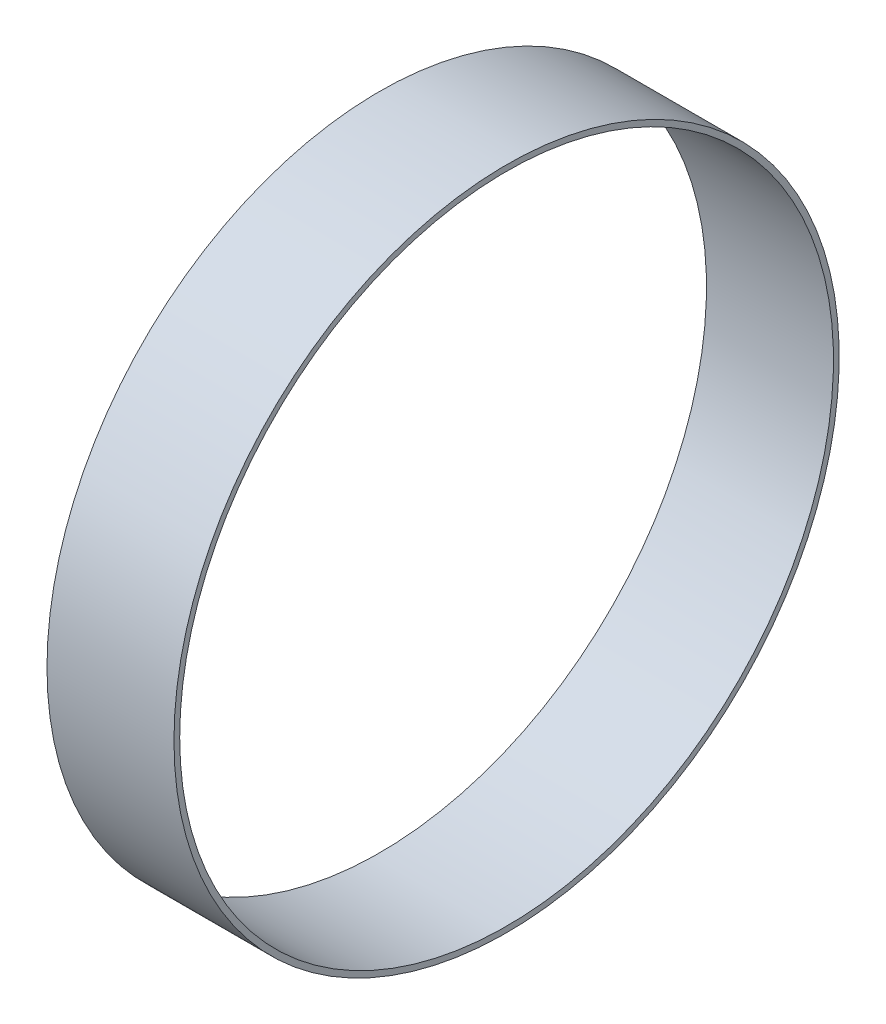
ISO-10303-21;
HEADER;
FILE_DESCRIPTION(('STEP AP214'),'2;1');
FILE_NAME('part.step','',(''),(''),'','','');
FILE_SCHEMA(('AUTOMOTIVE_DESIGN { 1 0 10303 214 1 1 1 1 }'));
ENDSEC;
DATA;
#1=APPLICATION_CONTEXT('core data for automotive mechanical design processes');
#2=APPLICATION_PROTOCOL_DEFINITION('international standard','automotive_design',2000,#1);
#3=PRODUCT_CONTEXT('',#1,'mechanical');
#4=PRODUCT('Part','Part','',(#3));
#5=PRODUCT_RELATED_PRODUCT_CATEGORY('part','',(#4));
#6=PRODUCT_DEFINITION_FORMATION('','',#4);
#7=PRODUCT_DEFINITION_CONTEXT('part definition',#1,'design');
#8=PRODUCT_DEFINITION('design','',#6,#7);
#9=PRODUCT_DEFINITION_SHAPE('','',#8);
#10=(LENGTH_UNIT() NAMED_UNIT(*) SI_UNIT(.MILLI.,.METRE.));
#11=(NAMED_UNIT(*) PLANE_ANGLE_UNIT() SI_UNIT($,.RADIAN.));
#12=(NAMED_UNIT(*) SI_UNIT($,.STERADIAN.) SOLID_ANGLE_UNIT());
#13=UNCERTAINTY_MEASURE_WITH_UNIT(LENGTH_MEASURE(1.E-05),#10,'distance_accuracy_value','');
#14=(GEOMETRIC_REPRESENTATION_CONTEXT(3) GLOBAL_UNCERTAINTY_ASSIGNED_CONTEXT((#13)) GLOBAL_UNIT_ASSIGNED_CONTEXT((#10,
#11,#12)) REPRESENTATION_CONTEXT('',''));
#15=CARTESIAN_POINT('',(0.,0.,0.));
#16=DIRECTION('',(0.,0.,1.));
#17=DIRECTION('',(1.,0.,0.));
#18=AXIS2_PLACEMENT_3D('',#15,#16,#17);
#19=CARTESIAN_POINT('',(56.2102,0.,0.));
#20=DIRECTION('',(1.,0.,0.));
#21=DIRECTION('',(0.,0.,-1.));
#22=AXIS2_PLACEMENT_3D('',#19,#20,#21);
#23=PLANE('',#22);
#24=CARTESIAN_POINT('',(56.2102,0.,0.));
#25=DIRECTION('',(1.,0.,0.));
#26=DIRECTION('',(0.,0.,-1.));
#27=AXIS2_PLACEMENT_3D('',#24,#25,#26);
#28=CIRCLE('',#27,147.2438);
#29=CARTESIAN_POINT('',(56.2102,0.,147.2438));
#30=VERTEX_POINT('',#29);
#31=EDGE_CURVE('E10',#30,#30,#28,.T.);
#32=ORIENTED_EDGE('',*,*,#31,.T.);
#33=EDGE_LOOP('',(#32));
#34=FACE_BOUND('',#33,.T.);
#35=CARTESIAN_POINT('',(56.2102,0.,0.));
#36=DIRECTION('',(1.,0.,0.));
#37=DIRECTION('',(0.,0.,-1.));
#38=AXIS2_PLACEMENT_3D('',#35,#36,#37);
#39=CIRCLE('',#38,144.7038);
#40=CARTESIAN_POINT('',(56.2102,0.,144.7038));
#41=VERTEX_POINT('',#40);
#42=EDGE_CURVE('E43',#41,#41,#39,.T.);
#43=ORIENTED_EDGE('',*,*,#42,.F.);
#44=EDGE_LOOP('',(#43));
#45=FACE_BOUND('',#44,.T.);
#46=ADVANCED_FACE('F32',(#34,#45),#23,.T.);
#47=CARTESIAN_POINT('',(0.,0.,0.));
#48=DIRECTION('',(1.,0.,0.));
#49=DIRECTION('',(0.,0.,-1.));
#50=AXIS2_PLACEMENT_3D('',#47,#48,#49);
#51=PLANE('',#50);
#52=CARTESIAN_POINT('',(0.,0.,0.));
#53=DIRECTION('',(1.,0.,0.));
#54=DIRECTION('',(0.,0.,-1.));
#55=AXIS2_PLACEMENT_3D('',#52,#53,#54);
#56=CIRCLE('',#55,147.2438);
#57=CARTESIAN_POINT('',(0.,0.,147.2438));
#58=VERTEX_POINT('',#57);
#59=EDGE_CURVE('E36',#58,#58,#56,.T.);
#60=ORIENTED_EDGE('',*,*,#59,.F.);
#61=EDGE_LOOP('',(#60));
#62=FACE_BOUND('',#61,.T.);
#63=CARTESIAN_POINT('',(0.,0.,0.));
#64=DIRECTION('',(1.,0.,0.));
#65=DIRECTION('',(0.,0.,-1.));
#66=AXIS2_PLACEMENT_3D('',#63,#64,#65);
#67=CIRCLE('',#66,144.7038);
#68=CARTESIAN_POINT('',(0.,0.,144.7038));
#69=VERTEX_POINT('',#68);
#70=EDGE_CURVE('E45',#69,#69,#67,.T.);
#71=ORIENTED_EDGE('',*,*,#70,.T.);
#72=EDGE_LOOP('',(#71));
#73=FACE_BOUND('',#72,.T.);
#74=ADVANCED_FACE('F55',(#62,#73),#51,.F.);
#75=CARTESIAN_POINT('',(56.2102,0.,0.));
#76=DIRECTION('',(-1.,0.,0.));
#77=DIRECTION('',(0.,0.,1.));
#78=AXIS2_PLACEMENT_3D('',#75,#76,#77);
#79=CYLINDRICAL_SURFACE('',#78,147.2438);
#80=CARTESIAN_POINT('',(56.2102,0.,147.2438));
#81=CARTESIAN_POINT('',(55.6246770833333,0.,147.2438));
#82=CARTESIAN_POINT('',(55.0391541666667,0.,147.2438));
#83=CARTESIAN_POINT('',(53.8681083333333,0.,147.2438));
#84=CARTESIAN_POINT('',(53.2825854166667,0.,147.2438));
#85=CARTESIAN_POINT('',(52.1115395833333,0.,147.2438));
#86=CARTESIAN_POINT('',(51.5260166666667,0.,147.2438));
#87=CARTESIAN_POINT('',(50.3549708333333,0.,147.2438));
#88=CARTESIAN_POINT('',(49.7694479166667,0.,147.2438));
#89=CARTESIAN_POINT('',(48.5984020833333,0.,147.2438));
#90=CARTESIAN_POINT('',(48.0128791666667,0.,147.2438));
#91=CARTESIAN_POINT('',(46.8418333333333,0.,147.2438));
#92=CARTESIAN_POINT('',(46.2563104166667,0.,147.2438));
#93=CARTESIAN_POINT('',(45.0852645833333,0.,147.2438));
#94=CARTESIAN_POINT('',(44.4997416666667,0.,147.2438));
#95=CARTESIAN_POINT('',(43.3286958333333,0.,147.2438));
#96=CARTESIAN_POINT('',(42.7431729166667,0.,147.2438));
#97=CARTESIAN_POINT('',(41.5721270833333,0.,147.2438));
#98=CARTESIAN_POINT('',(40.9866041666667,0.,147.2438));
#99=CARTESIAN_POINT('',(39.8155583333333,0.,147.2438));
#100=CARTESIAN_POINT('',(39.2300354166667,0.,147.2438));
#101=CARTESIAN_POINT('',(38.0589895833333,0.,147.2438));
#102=CARTESIAN_POINT('',(37.4734666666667,0.,147.2438));
#103=CARTESIAN_POINT('',(36.3024208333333,0.,147.2438));
#104=CARTESIAN_POINT('',(35.7168979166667,0.,147.2438));
#105=CARTESIAN_POINT('',(34.5458520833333,0.,147.2438));
#106=CARTESIAN_POINT('',(33.9603291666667,0.,147.2438));
#107=CARTESIAN_POINT('',(32.7892833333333,0.,147.2438));
#108=CARTESIAN_POINT('',(32.2037604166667,0.,147.2438));
#109=CARTESIAN_POINT('',(31.0327145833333,0.,147.2438));
#110=CARTESIAN_POINT('',(30.4471916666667,0.,147.2438));
#111=CARTESIAN_POINT('',(29.2761458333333,0.,147.2438));
#112=CARTESIAN_POINT('',(28.6906229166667,0.,147.2438));
#113=CARTESIAN_POINT('',(27.5195770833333,0.,147.2438));
#114=CARTESIAN_POINT('',(26.9340541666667,0.,147.2438));
#115=CARTESIAN_POINT('',(25.7630083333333,0.,147.2438));
#116=CARTESIAN_POINT('',(25.1774854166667,0.,147.2438));
#117=CARTESIAN_POINT('',(24.0064395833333,0.,147.2438));
#118=CARTESIAN_POINT('',(23.4209166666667,0.,147.2438));
#119=CARTESIAN_POINT('',(22.2498708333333,0.,147.2438));
#120=CARTESIAN_POINT('',(21.6643479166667,0.,147.2438));
#121=CARTESIAN_POINT('',(20.4933020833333,0.,147.2438));
#122=CARTESIAN_POINT('',(19.9077791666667,0.,147.2438));
#123=CARTESIAN_POINT('',(18.7367333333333,0.,147.2438));
#124=CARTESIAN_POINT('',(18.1512104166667,0.,147.2438));
#125=CARTESIAN_POINT('',(16.9801645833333,0.,147.2438));
#126=CARTESIAN_POINT('',(16.3946416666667,0.,147.2438));
#127=CARTESIAN_POINT('',(15.2235958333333,0.,147.2438));
#128=CARTESIAN_POINT('',(14.6380729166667,0.,147.2438));
#129=CARTESIAN_POINT('',(13.4670270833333,0.,147.2438));
#130=CARTESIAN_POINT('',(12.8815041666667,0.,147.2438));
#131=CARTESIAN_POINT('',(11.7104583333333,0.,147.2438));
#132=CARTESIAN_POINT('',(11.1249354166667,0.,147.2438));
#133=CARTESIAN_POINT('',(9.95388958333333,0.,147.2438));
#134=CARTESIAN_POINT('',(9.36836666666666,0.,147.2438));
#135=CARTESIAN_POINT('',(8.19732083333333,0.,147.2438));
#136=CARTESIAN_POINT('',(7.61179791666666,0.,147.2438));
#137=CARTESIAN_POINT('',(6.44075208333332,0.,147.2438));
#138=CARTESIAN_POINT('',(5.85522916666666,0.,147.2438));
#139=CARTESIAN_POINT('',(4.68418333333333,0.,147.2438));
#140=CARTESIAN_POINT('',(4.09866041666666,0.,147.2438));
#141=CARTESIAN_POINT('',(2.92761458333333,0.,147.2438));
#142=CARTESIAN_POINT('',(2.34209166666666,0.,147.2438));
#143=CARTESIAN_POINT('',(1.17104583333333,0.,147.2438));
#144=CARTESIAN_POINT('',(0.58552291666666,0.,147.2438));
#145=CARTESIAN_POINT('',(0.,0.,147.2438));
#146=B_SPLINE_CURVE_WITH_KNOTS('',3,(#80,#81,#82,#83,#84,#85,#86,#87,#88,#89,#90,#91,#92,#93,
#94,#95,#96,#97,#98,#99,#100,#101,#102,#103,#104,#105,#106,#107,#108,#109,#110,#111,#112,#113,
#114,#115,#116,#117,#118,#119,#120,#121,#122,#123,#124,#125,#126,#127,#128,#129,#130,#131,#132,
#133,#134,#135,#136,#137,#138,#139,#140,#141,#142,#143,#144,#145),.UNSPECIFIED.,.F.,.F.,(4,2,2,
2,2,2,2,2,2,2,2,2,2,2,2,2,2,2,2,2,2,2,2,2,2,2,2,2,2,2,2,2,4),(0.,1.75656875,3.5131375,
5.26970625,7.026275,8.78284375,10.5394125,12.29598125,14.05255,15.80911875,17.5656875,
19.32225625,21.078825,22.83539375,24.5919625,26.34853125,28.1051,29.86166875,31.6182375,
33.37480625,35.131375,36.88794375,38.6445125,40.40108125,42.15765,43.91421875,45.6707875,
47.42735625,49.183925,50.94049375,52.6970625,54.45363125,56.2102),.UNSPECIFIED.);
#147=EDGE_CURVE('BSEAM34',#30,#58,#146,.T.);
#148=ORIENTED_EDGE('',*,*,#31,.F.);
#149=ORIENTED_EDGE('',*,*,#59,.T.);
#150=ORIENTED_EDGE('',*,*,#147,.T.);
#151=ORIENTED_EDGE('',*,*,#147,.F.);
#152=EDGE_LOOP('',(#148,#150,#149,#151));
#153=FACE_BOUND('',#152,.T.);
#154=ADVANCED_FACE('F34',(#153),#79,.T.);
#155=CARTESIAN_POINT('',(56.2102,0.,0.));
#156=DIRECTION('',(-1.,0.,0.));
#157=DIRECTION('',(0.,0.,1.));
#158=AXIS2_PLACEMENT_3D('',#155,#156,#157);
#159=CYLINDRICAL_SURFACE('',#158,144.7038);
#160=CARTESIAN_POINT('',(56.2102,0.,144.7038));
#161=CARTESIAN_POINT('',(55.6246770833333,0.,144.7038));
#162=CARTESIAN_POINT('',(55.0391541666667,0.,144.7038));
#163=CARTESIAN_POINT('',(53.8681083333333,0.,144.7038));
#164=CARTESIAN_POINT('',(53.2825854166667,0.,144.7038));
#165=CARTESIAN_POINT('',(52.1115395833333,0.,144.7038));
#166=CARTESIAN_POINT('',(51.5260166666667,0.,144.7038));
#167=CARTESIAN_POINT('',(50.3549708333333,0.,144.7038));
#168=CARTESIAN_POINT('',(49.7694479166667,0.,144.7038));
#169=CARTESIAN_POINT('',(48.5984020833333,0.,144.7038));
#170=CARTESIAN_POINT('',(48.0128791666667,0.,144.7038));
#171=CARTESIAN_POINT('',(46.8418333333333,0.,144.7038));
#172=CARTESIAN_POINT('',(46.2563104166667,0.,144.7038));
#173=CARTESIAN_POINT('',(45.0852645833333,0.,144.7038));
#174=CARTESIAN_POINT('',(44.4997416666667,0.,144.7038));
#175=CARTESIAN_POINT('',(43.3286958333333,0.,144.7038));
#176=CARTESIAN_POINT('',(42.7431729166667,0.,144.7038));
#177=CARTESIAN_POINT('',(41.5721270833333,0.,144.7038));
#178=CARTESIAN_POINT('',(40.9866041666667,0.,144.7038));
#179=CARTESIAN_POINT('',(39.8155583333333,0.,144.7038));
#180=CARTESIAN_POINT('',(39.2300354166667,0.,144.7038));
#181=CARTESIAN_POINT('',(38.0589895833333,0.,144.7038));
#182=CARTESIAN_POINT('',(37.4734666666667,0.,144.7038));
#183=CARTESIAN_POINT('',(36.3024208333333,0.,144.7038));
#184=CARTESIAN_POINT('',(35.7168979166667,0.,144.7038));
#185=CARTESIAN_POINT('',(34.5458520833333,0.,144.7038));
#186=CARTESIAN_POINT('',(33.9603291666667,0.,144.7038));
#187=CARTESIAN_POINT('',(32.7892833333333,0.,144.7038));
#188=CARTESIAN_POINT('',(32.2037604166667,0.,144.7038));
#189=CARTESIAN_POINT('',(31.0327145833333,0.,144.7038));
#190=CARTESIAN_POINT('',(30.4471916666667,0.,144.7038));
#191=CARTESIAN_POINT('',(29.2761458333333,0.,144.7038));
#192=CARTESIAN_POINT('',(28.6906229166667,0.,144.7038));
#193=CARTESIAN_POINT('',(27.5195770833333,0.,144.7038));
#194=CARTESIAN_POINT('',(26.9340541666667,0.,144.7038));
#195=CARTESIAN_POINT('',(25.7630083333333,0.,144.7038));
#196=CARTESIAN_POINT('',(25.1774854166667,0.,144.7038));
#197=CARTESIAN_POINT('',(24.0064395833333,0.,144.7038));
#198=CARTESIAN_POINT('',(23.4209166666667,0.,144.7038));
#199=CARTESIAN_POINT('',(22.2498708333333,0.,144.7038));
#200=CARTESIAN_POINT('',(21.6643479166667,0.,144.7038));
#201=CARTESIAN_POINT('',(20.4933020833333,0.,144.7038));
#202=CARTESIAN_POINT('',(19.9077791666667,0.,144.7038));
#203=CARTESIAN_POINT('',(18.7367333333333,0.,144.7038));
#204=CARTESIAN_POINT('',(18.1512104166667,0.,144.7038));
#205=CARTESIAN_POINT('',(16.9801645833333,0.,144.7038));
#206=CARTESIAN_POINT('',(16.3946416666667,0.,144.7038));
#207=CARTESIAN_POINT('',(15.2235958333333,0.,144.7038));
#208=CARTESIAN_POINT('',(14.6380729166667,0.,144.7038));
#209=CARTESIAN_POINT('',(13.4670270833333,0.,144.7038));
#210=CARTESIAN_POINT('',(12.8815041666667,0.,144.7038));
#211=CARTESIAN_POINT('',(11.7104583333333,0.,144.7038));
#212=CARTESIAN_POINT('',(11.1249354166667,0.,144.7038));
#213=CARTESIAN_POINT('',(9.95388958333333,0.,144.7038));
#214=CARTESIAN_POINT('',(9.36836666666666,0.,144.7038));
#215=CARTESIAN_POINT('',(8.19732083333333,0.,144.7038));
#216=CARTESIAN_POINT('',(7.61179791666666,0.,144.7038));
#217=CARTESIAN_POINT('',(6.44075208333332,0.,144.7038));
#218=CARTESIAN_POINT('',(5.85522916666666,0.,144.7038));
#219=CARTESIAN_POINT('',(4.68418333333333,0.,144.7038));
#220=CARTESIAN_POINT('',(4.09866041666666,0.,144.7038));
#221=CARTESIAN_POINT('',(2.92761458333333,0.,144.7038));
#222=CARTESIAN_POINT('',(2.34209166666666,0.,144.7038));
#223=CARTESIAN_POINT('',(1.17104583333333,0.,144.7038));
#224=CARTESIAN_POINT('',(0.58552291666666,0.,144.7038));
#225=CARTESIAN_POINT('',(0.,0.,144.7038));
#226=B_SPLINE_CURVE_WITH_KNOTS('',3,(#160,#161,#162,#163,#164,#165,#166,#167,#168,#169,#170,
#171,#172,#173,#174,#175,#176,#177,#178,#179,#180,#181,#182,#183,#184,#185,#186,#187,#188,#189,
#190,#191,#192,#193,#194,#195,#196,#197,#198,#199,#200,#201,#202,#203,#204,#205,#206,#207,#208,
#209,#210,#211,#212,#213,#214,#215,#216,#217,#218,#219,#220,#221,#222,#223,#224,#225),
.UNSPECIFIED.,.F.,.F.,(4,2,2,2,2,2,2,2,2,2,2,2,2,2,2,2,2,2,2,2,2,2,2,2,2,2,2,2,2,2,2,2,4),(0.,
1.75656875,3.5131375,5.26970625,7.026275,8.78284375,10.5394125,12.29598125,14.05255,15.80911875,
17.5656875,19.32225625,21.078825,22.83539375,24.5919625,26.34853125,28.1051,29.86166875,
31.6182375,33.37480625,35.131375,36.88794375,38.6445125,40.40108125,42.15765,43.91421875,
45.6707875,47.42735625,49.183925,50.94049375,52.6970625,54.45363125,56.2102),.UNSPECIFIED.);
#227=EDGE_CURVE('BSEAM51',#41,#69,#226,.T.);
#228=ORIENTED_EDGE('',*,*,#42,.T.);
#229=ORIENTED_EDGE('',*,*,#70,.F.);
#230=ORIENTED_EDGE('',*,*,#227,.T.);
#231=ORIENTED_EDGE('',*,*,#227,.F.);
#232=EDGE_LOOP('',(#228,#230,#229,#231));
#233=FACE_BOUND('',#232,.T.);
#234=ADVANCED_FACE('F51',(#233),#159,.F.);
#235=CLOSED_SHELL('',(#46,#74,#154,#234));
#236=MANIFOLD_SOLID_BREP('B2',#235);
#237=ADVANCED_BREP_SHAPE_REPRESENTATION('',(#18,#236),#14);
#238=SHAPE_DEFINITION_REPRESENTATION(#9,#237);
ENDSEC;
END-ISO-10303-21;
